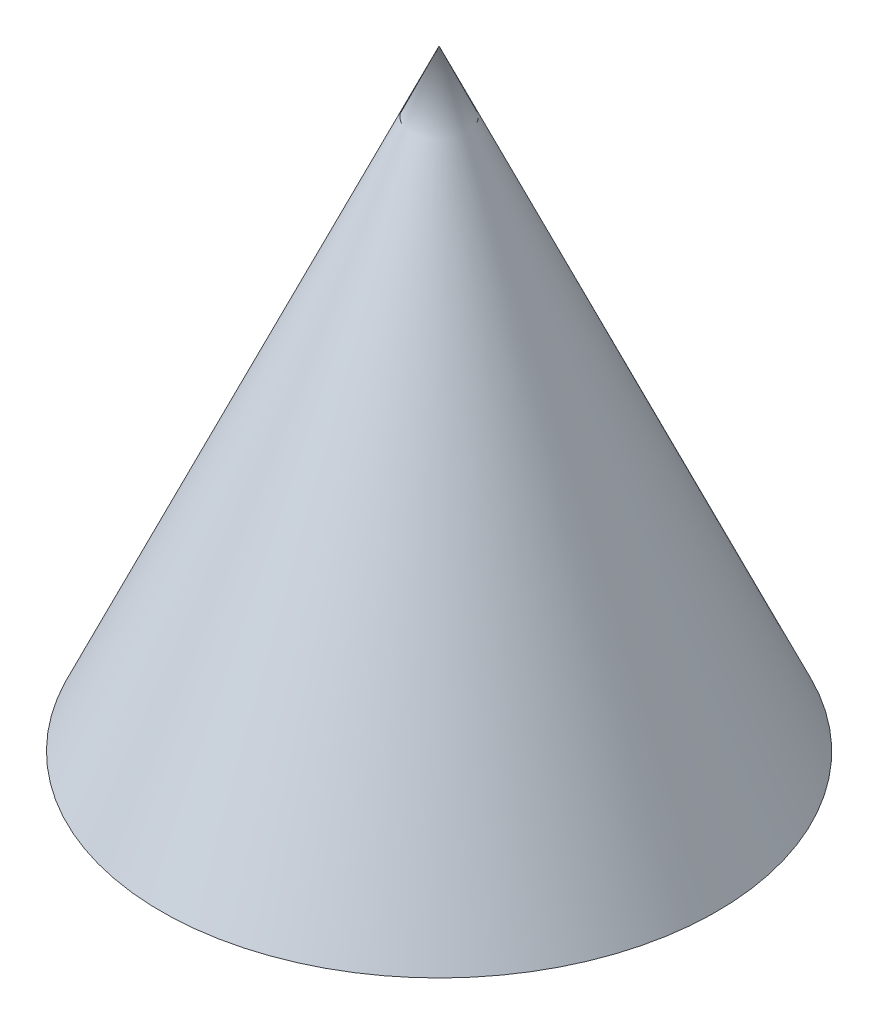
from build123d import *

# Parameters (mm, degrees)
SHELL_1_T = -1


with BuildPart() as part:
    # Sketch 1 → Revolve 1 (revolve)
    with BuildSketch(Plane.XY, mode=Mode.PRIVATE) as revolve_1_sk:
        Polygon((0, 110), (50, 0), (0, 0), align=None)
    revolve(revolve_1_sk.sketch.rotate(Axis((0, 0, 0), (0, 1, 0)), 90), axis=Axis((0, 0, 0), (0, 1, 0)))

    # Shell 1
    shell_1_openings = [part.faces().sort_by_distance(p)[0] for p in [
        (0, 0, 0),
    ]]
    offset(amount=SHELL_1_T, openings=shell_1_openings, kind=Kind.INTERSECTION)


solid = part.part
